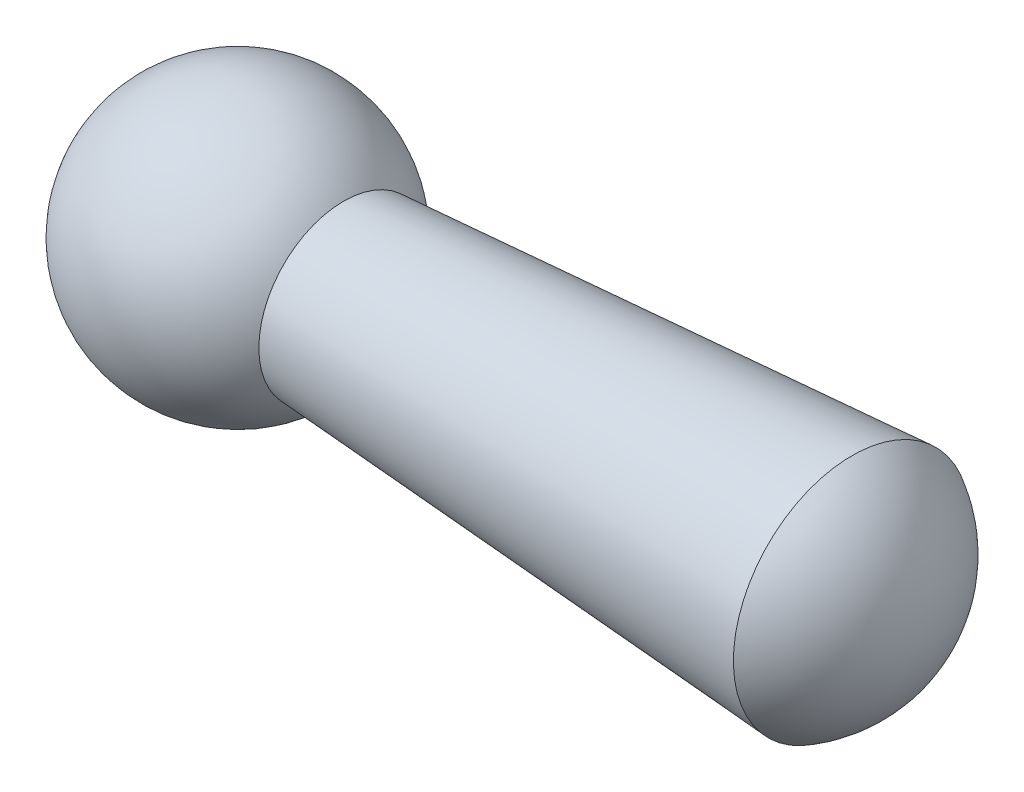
ISO-10303-21;
HEADER;
FILE_DESCRIPTION(('STEP AP214'),'2;1');
FILE_NAME('part.step','',(''),(''),'','','');
FILE_SCHEMA(('AUTOMOTIVE_DESIGN { 1 0 10303 214 1 1 1 1 }'));
ENDSEC;
DATA;
#1=APPLICATION_CONTEXT('core data for automotive mechanical design processes');
#2=APPLICATION_PROTOCOL_DEFINITION('international standard','automotive_design',2000,#1);
#3=PRODUCT_CONTEXT('',#1,'mechanical');
#4=PRODUCT('Part','Part','',(#3));
#5=PRODUCT_RELATED_PRODUCT_CATEGORY('part','',(#4));
#6=PRODUCT_DEFINITION_FORMATION('','',#4);
#7=PRODUCT_DEFINITION_CONTEXT('part definition',#1,'design');
#8=PRODUCT_DEFINITION('design','',#6,#7);
#9=PRODUCT_DEFINITION_SHAPE('','',#8);
#10=(LENGTH_UNIT() NAMED_UNIT(*) SI_UNIT(.MILLI.,.METRE.));
#11=(NAMED_UNIT(*) PLANE_ANGLE_UNIT() SI_UNIT($,.RADIAN.));
#12=(NAMED_UNIT(*) SI_UNIT($,.STERADIAN.) SOLID_ANGLE_UNIT());
#13=UNCERTAINTY_MEASURE_WITH_UNIT(LENGTH_MEASURE(1.E-05),#10,'distance_accuracy_value','');
#14=(GEOMETRIC_REPRESENTATION_CONTEXT(3) GLOBAL_UNCERTAINTY_ASSIGNED_CONTEXT((#13)) GLOBAL_UNIT_ASSIGNED_CONTEXT((#10,
#11,#12)) REPRESENTATION_CONTEXT('',''));
#15=CARTESIAN_POINT('',(0.,0.,0.));
#16=DIRECTION('',(0.,0.,1.));
#17=DIRECTION('',(1.,0.,0.));
#18=AXIS2_PLACEMENT_3D('',#15,#16,#17);
#19=CARTESIAN_POINT('',(0.,0.,0.));
#20=DIRECTION('',(-1.,0.,0.));
#21=DIRECTION('',(0.,1.,0.));
#22=AXIS2_PLACEMENT_3D('',#19,#20,#21);
#23=SPHERICAL_SURFACE('',#22,4.);
#24=CARTESIAN_POINT('',(3.1224989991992,0.,0.));
#25=DIRECTION('',(-1.,0.,0.));
#26=DIRECTION('',(0.,-1.,0.));
#27=AXIS2_PLACEMENT_3D('',#24,#25,#26);
#28=CIRCLE('',#27,2.5);
#29=CARTESIAN_POINT('',(3.1224989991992,-2.5,0.));
#30=VERTEX_POINT('',#29);
#31=EDGE_CURVE('E37',#30,#30,#28,.T.);
#32=ORIENTED_EDGE('',*,*,#31,.T.);
#33=EDGE_LOOP('',(#32));
#34=FACE_BOUND('',#33,.T.);
#35=ADVANCED_FACE('F31',(#34),#23,.T.);
#36=CARTESIAN_POINT('',(16.1860073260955,0.,0.));
#37=DIRECTION('',(-1.,0.,0.));
#38=DIRECTION('',(0.,-1.,0.));
#39=AXIS2_PLACEMENT_3D('',#36,#37,#38);
#40=SPHERICAL_SURFACE('',#39,4.);
#41=CARTESIAN_POINT('',(18.1224989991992,0.,0.));
#42=DIRECTION('',(-1.,0.,0.));
#43=DIRECTION('',(0.,-1.,0.));
#44=AXIS2_PLACEMENT_3D('',#41,#42,#43);
#45=CIRCLE('',#44,3.5);
#46=CARTESIAN_POINT('',(18.1224989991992,-3.50000000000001,0.));
#47=VERTEX_POINT('',#46);
#48=EDGE_CURVE('E10',#47,#47,#45,.T.);
#49=ORIENTED_EDGE('',*,*,#48,.F.);
#50=EDGE_LOOP('',(#49));
#51=FACE_BOUND('',#50,.T.);
#52=ADVANCED_FACE('F46',(#51),#40,.T.);
#53=CARTESIAN_POINT('',(18.1224989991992,0.,0.));
#54=DIRECTION('',(1.,0.,0.));
#55=DIRECTION('',(0.,1.,0.));
#56=AXIS2_PLACEMENT_3D('',#53,#54,#55);
#57=CONICAL_SURFACE('',#56,3.5,0.066568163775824);
#58=ORIENTED_EDGE('',*,*,#31,.F.);
#59=EDGE_LOOP('',(#58));
#60=FACE_BOUND('',#59,.T.);
#61=ORIENTED_EDGE('',*,*,#48,.T.);
#62=EDGE_LOOP('',(#61));
#63=FACE_BOUND('',#62,.T.);
#64=ADVANCED_FACE('F44',(#60,#63),#57,.T.);
#65=CLOSED_SHELL('',(#35,#52,#64));
#66=MANIFOLD_SOLID_BREP('B2',#65);
#67=ADVANCED_BREP_SHAPE_REPRESENTATION('',(#18,#66),#14);
#68=SHAPE_DEFINITION_REPRESENTATION(#9,#67);
ENDSEC;
END-ISO-10303-21;
